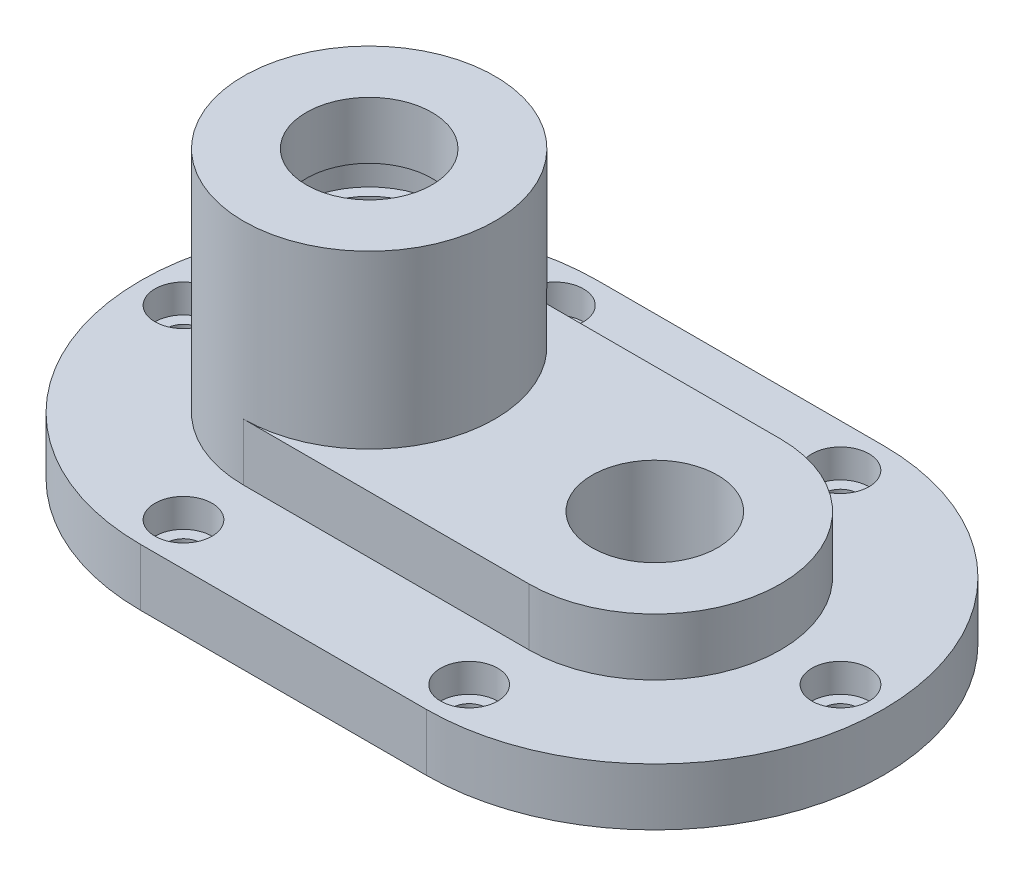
ISO-10303-21;
HEADER;
FILE_DESCRIPTION(('STEP AP214'),'2;1');
FILE_NAME('part.step','',(''),(''),'','','');
FILE_SCHEMA(('AUTOMOTIVE_DESIGN { 1 0 10303 214 1 1 1 1 }'));
ENDSEC;
DATA;
#1=APPLICATION_CONTEXT('core data for automotive mechanical design processes');
#2=APPLICATION_PROTOCOL_DEFINITION('international standard','automotive_design',2000,#1);
#3=PRODUCT_CONTEXT('',#1,'mechanical');
#4=PRODUCT('Part','Part','',(#3));
#5=PRODUCT_RELATED_PRODUCT_CATEGORY('part','',(#4));
#6=PRODUCT_DEFINITION_FORMATION('','',#4);
#7=PRODUCT_DEFINITION_CONTEXT('part definition',#1,'design');
#8=PRODUCT_DEFINITION('design','',#6,#7);
#9=PRODUCT_DEFINITION_SHAPE('','',#8);
#10=(LENGTH_UNIT() NAMED_UNIT(*) SI_UNIT(.MILLI.,.METRE.));
#11=(NAMED_UNIT(*) PLANE_ANGLE_UNIT() SI_UNIT($,.RADIAN.));
#12=(NAMED_UNIT(*) SI_UNIT($,.STERADIAN.) SOLID_ANGLE_UNIT());
#13=UNCERTAINTY_MEASURE_WITH_UNIT(LENGTH_MEASURE(1.E-05),#10,'distance_accuracy_value','');
#14=(GEOMETRIC_REPRESENTATION_CONTEXT(3) GLOBAL_UNCERTAINTY_ASSIGNED_CONTEXT((#13)) GLOBAL_UNIT_ASSIGNED_CONTEXT((#10,
#11,#12)) REPRESENTATION_CONTEXT('',''));
#15=CARTESIAN_POINT('',(0.,0.,0.));
#16=DIRECTION('',(0.,0.,1.));
#17=DIRECTION('',(1.,0.,0.));
#18=AXIS2_PLACEMENT_3D('',#15,#16,#17);
#19=CARTESIAN_POINT('',(0.,0.,-40.));
#20=DIRECTION('',(0.,1.,0.));
#21=DIRECTION('',(0.,0.,1.));
#22=AXIS2_PLACEMENT_3D('',#19,#20,#21);
#23=CYLINDRICAL_SURFACE('',#22,11.);
#24=CARTESIAN_POINT('',(0.,0.,-40.));
#25=DIRECTION('',(0.,1.,0.));
#26=DIRECTION('',(0.,0.,1.));
#27=AXIS2_PLACEMENT_3D('',#24,#25,#26);
#28=CIRCLE('',#27,11.);
#29=CARTESIAN_POINT('',(0.,0.,-29.));
#30=VERTEX_POINT('',#29);
#31=EDGE_CURVE('E361',#30,#30,#28,.T.);
#32=ORIENTED_EDGE('',*,*,#31,.F.);
#33=EDGE_LOOP('',(#32));
#34=FACE_BOUND('',#33,.T.);
#35=CARTESIAN_POINT('',(0.,35.,-40.));
#36=DIRECTION('',(0.,1.,0.));
#37=DIRECTION('',(0.,0.,1.));
#38=AXIS2_PLACEMENT_3D('',#35,#36,#37);
#39=CIRCLE('',#38,11.);
#40=CARTESIAN_POINT('',(0.,35.,-29.));
#41=VERTEX_POINT('',#40);
#42=EDGE_CURVE('E376',#41,#41,#39,.T.);
#43=ORIENTED_EDGE('',*,*,#42,.T.);
#44=EDGE_LOOP('',(#43));
#45=FACE_BOUND('',#44,.T.);
#46=ADVANCED_FACE('F45',(#34,#45),#23,.F.);
#47=CARTESIAN_POINT('',(0.,10.,-40.));
#48=DIRECTION('',(0.,-1.,0.));
#49=DIRECTION('',(0.,0.,-1.));
#50=AXIS2_PLACEMENT_3D('',#47,#48,#49);
#51=PLANE('',#50);
#52=CARTESIAN_POINT('',(0.,10.,-40.));
#53=DIRECTION('',(0.,1.,0.));
#54=DIRECTION('',(0.,0.,-1.));
#55=AXIS2_PLACEMENT_3D('',#52,#53,#54);
#56=CIRCLE('',#55,40.);
#57=CARTESIAN_POINT('',(0.,10.,-80.));
#58=VERTEX_POINT('',#57);
#59=CARTESIAN_POINT('',(0.,10.,0.));
#60=VERTEX_POINT('',#59);
#61=EDGE_CURVE('E266',#58,#60,#56,.T.);
#62=ORIENTED_EDGE('',*,*,#61,.T.);
#63=DIRECTION('',(1.,0.,0.));
#64=VECTOR('',#63,1.);
#65=CARTESIAN_POINT('',(0.,10.,0.));
#66=LINE('',#65,#64);
#67=CARTESIAN_POINT('',(50.,10.,0.));
#68=VERTEX_POINT('',#67);
#69=EDGE_CURVE('E270',#60,#68,#66,.T.);
#70=ORIENTED_EDGE('',*,*,#69,.T.);
#71=CARTESIAN_POINT('',(50.,10.,-40.));
#72=DIRECTION('',(0.,1.,0.));
#73=DIRECTION('',(0.,0.,1.));
#74=AXIS2_PLACEMENT_3D('',#71,#72,#73);
#75=CIRCLE('',#74,40.);
#76=CARTESIAN_POINT('',(50.,10.,-80.));
#77=VERTEX_POINT('',#76);
#78=EDGE_CURVE('E274',#68,#77,#75,.T.);
#79=ORIENTED_EDGE('',*,*,#78,.T.);
#80=DIRECTION('',(-1.,0.,0.));
#81=VECTOR('',#80,1.);
#82=CARTESIAN_POINT('',(50.,10.,-80.));
#83=LINE('',#82,#81);
#84=EDGE_CURVE('E277',#77,#58,#83,.T.);
#85=ORIENTED_EDGE('',*,*,#84,.T.);
#86=EDGE_LOOP('',(#62,#70,#79,#85));
#87=FACE_BOUND('',#86,.T.);
#88=CARTESIAN_POINT('',(0.,10.,-72.5));
#89=DIRECTION('',(0.,1.,0.));
#90=DIRECTION('',(0.,0.,1.));
#91=AXIS2_PLACEMENT_3D('',#88,#89,#90);
#92=CIRCLE('',#91,5.);
#93=CARTESIAN_POINT('',(0.,10.,-67.5));
#94=VERTEX_POINT('',#93);
#95=EDGE_CURVE('E222',#94,#94,#92,.T.);
#96=ORIENTED_EDGE('',*,*,#95,.F.);
#97=EDGE_LOOP('',(#96));
#98=FACE_BOUND('',#97,.T.);
#99=CARTESIAN_POINT('',(50.,10.,-72.5));
#100=DIRECTION('',(0.,1.,0.));
#101=DIRECTION('',(0.,0.,1.));
#102=AXIS2_PLACEMENT_3D('',#99,#100,#101);
#103=CIRCLE('',#102,5.);
#104=CARTESIAN_POINT('',(50.,10.,-67.5));
#105=VERTEX_POINT('',#104);
#106=EDGE_CURVE('E223',#105,#105,#103,.T.);
#107=ORIENTED_EDGE('',*,*,#106,.F.);
#108=EDGE_LOOP('',(#107));
#109=FACE_BOUND('',#108,.T.);
#110=CARTESIAN_POINT('',(-32.5,10.,-40.));
#111=DIRECTION('',(0.,1.,0.));
#112=DIRECTION('',(0.,0.,1.));
#113=AXIS2_PLACEMENT_3D('',#110,#111,#112);
#114=CIRCLE('',#113,5.);
#115=CARTESIAN_POINT('',(-32.5,10.,-35.));
#116=VERTEX_POINT('',#115);
#117=EDGE_CURVE('E231',#116,#116,#114,.T.);
#118=ORIENTED_EDGE('',*,*,#117,.F.);
#119=EDGE_LOOP('',(#118));
#120=FACE_BOUND('',#119,.T.);
#121=CARTESIAN_POINT('',(0.,10.,-7.5));
#122=DIRECTION('',(0.,1.,0.));
#123=DIRECTION('',(0.,0.,1.));
#124=AXIS2_PLACEMENT_3D('',#121,#122,#123);
#125=CIRCLE('',#124,5.);
#126=CARTESIAN_POINT('',(0.,10.,-2.5));
#127=VERTEX_POINT('',#126);
#128=EDGE_CURVE('E239',#127,#127,#125,.T.);
#129=ORIENTED_EDGE('',*,*,#128,.F.);
#130=EDGE_LOOP('',(#129));
#131=FACE_BOUND('',#130,.T.);
#132=CARTESIAN_POINT('',(50.,10.,-7.5));
#133=DIRECTION('',(0.,1.,0.));
#134=DIRECTION('',(0.,0.,1.));
#135=AXIS2_PLACEMENT_3D('',#132,#133,#134);
#136=CIRCLE('',#135,5.);
#137=CARTESIAN_POINT('',(50.,10.,-2.5));
#138=VERTEX_POINT('',#137);
#139=EDGE_CURVE('E247',#138,#138,#136,.T.);
#140=ORIENTED_EDGE('',*,*,#139,.F.);
#141=EDGE_LOOP('',(#140));
#142=FACE_BOUND('',#141,.T.);
#143=CARTESIAN_POINT('',(82.5,10.,-40.));
#144=DIRECTION('',(0.,1.,0.));
#145=DIRECTION('',(0.,0.,1.));
#146=AXIS2_PLACEMENT_3D('',#143,#144,#145);
#147=CIRCLE('',#146,5.00000000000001);
#148=CARTESIAN_POINT('',(82.5,10.,-35.));
#149=VERTEX_POINT('',#148);
#150=EDGE_CURVE('E174',#149,#149,#147,.T.);
#151=ORIENTED_EDGE('',*,*,#150,.F.);
#152=EDGE_LOOP('',(#151));
#153=FACE_BOUND('',#152,.T.);
#154=CARTESIAN_POINT('',(50.,10.,-40.));
#155=DIRECTION('',(0.,1.,0.));
#156=DIRECTION('',(0.,0.,1.));
#157=AXIS2_PLACEMENT_3D('',#154,#155,#156);
#158=CIRCLE('',#157,22.);
#159=CARTESIAN_POINT('',(50.,10.,-18.));
#160=VERTEX_POINT('',#159);
#161=CARTESIAN_POINT('',(50.,10.,-62.));
#162=VERTEX_POINT('',#161);
#163=EDGE_CURVE('E141',#160,#162,#158,.T.);
#164=ORIENTED_EDGE('',*,*,#163,.F.);
#165=DIRECTION('',(1.,0.,0.));
#166=VECTOR('',#165,1.);
#167=CARTESIAN_POINT('',(0.,10.,-18.));
#168=LINE('',#167,#166);
#169=CARTESIAN_POINT('',(0.,10.,-18.));
#170=VERTEX_POINT('',#169);
#171=EDGE_CURVE('E150',#170,#160,#168,.T.);
#172=ORIENTED_EDGE('',*,*,#171,.F.);
#173=CARTESIAN_POINT('',(0.,10.,-40.));
#174=DIRECTION('',(0.,1.,0.));
#175=DIRECTION('',(0.,0.,1.));
#176=AXIS2_PLACEMENT_3D('',#173,#174,#175);
#177=CIRCLE('',#176,22.);
#178=CARTESIAN_POINT('',(0.,10.,-62.));
#179=VERTEX_POINT('',#178);
#180=EDGE_CURVE('E67',#179,#170,#177,.T.);
#181=ORIENTED_EDGE('',*,*,#180,.F.);
#182=DIRECTION('',(-1.,0.,0.));
#183=VECTOR('',#182,1.);
#184=CARTESIAN_POINT('',(50.,10.,-62.));
#185=LINE('',#184,#183);
#186=EDGE_CURVE('E62',#162,#179,#185,.T.);
#187=ORIENTED_EDGE('',*,*,#186,.F.);
#188=EDGE_LOOP('',(#164,#172,#181,#187));
#189=FACE_BOUND('',#188,.T.);
#190=ADVANCED_FACE('F320',(#87,#98,#109,#120,#131,#142,#153,#189),#51,.F.);
#191=CARTESIAN_POINT('',(0.,10.,-40.));
#192=DIRECTION('',(0.,-1.,0.));
#193=DIRECTION('',(0.,0.,-1.));
#194=AXIS2_PLACEMENT_3D('',#191,#192,#193);
#195=CYLINDRICAL_SURFACE('',#194,40.);
#196=CARTESIAN_POINT('',(0.,0.,-40.));
#197=DIRECTION('',(0.,1.,0.));
#198=DIRECTION('',(0.,0.,-1.));
#199=AXIS2_PLACEMENT_3D('',#196,#197,#198);
#200=CIRCLE('',#199,40.);
#201=CARTESIAN_POINT('',(0.,0.,-80.));
#202=VERTEX_POINT('',#201);
#203=CARTESIAN_POINT('',(0.,0.,0.));
#204=VERTEX_POINT('',#203);
#205=EDGE_CURVE('E262',#202,#204,#200,.T.);
#206=ORIENTED_EDGE('',*,*,#205,.T.);
#207=DIRECTION('',(0.,-1.,0.));
#208=VECTOR('',#207,1.);
#209=CARTESIAN_POINT('',(0.,10.,0.));
#210=LINE('',#209,#208);
#211=EDGE_CURVE('E11',#60,#204,#210,.T.);
#212=ORIENTED_EDGE('',*,*,#211,.F.);
#213=ORIENTED_EDGE('',*,*,#61,.F.);
#214=DIRECTION('',(0.,-1.,0.));
#215=VECTOR('',#214,1.);
#216=CARTESIAN_POINT('',(0.,10.,-80.));
#217=LINE('',#216,#215);
#218=EDGE_CURVE('E280',#58,#202,#217,.T.);
#219=ORIENTED_EDGE('',*,*,#218,.T.);
#220=EDGE_LOOP('',(#206,#212,#213,#219));
#221=FACE_BOUND('',#220,.T.);
#222=ADVANCED_FACE('F47',(#221),#195,.T.);
#223=CARTESIAN_POINT('',(0.,10.,0.));
#224=DIRECTION('',(0.,0.,-1.));
#225=DIRECTION('',(-1.,0.,0.));
#226=AXIS2_PLACEMENT_3D('',#223,#224,#225);
#227=PLANE('',#226);
#228=DIRECTION('',(1.,0.,0.));
#229=VECTOR('',#228,1.);
#230=CARTESIAN_POINT('',(0.,0.,0.));
#231=LINE('',#230,#229);
#232=CARTESIAN_POINT('',(50.,0.,0.));
#233=VERTEX_POINT('',#232);
#234=EDGE_CURVE('E284',#204,#233,#231,.T.);
#235=ORIENTED_EDGE('',*,*,#234,.T.);
#236=DIRECTION('',(0.,-1.,0.));
#237=VECTOR('',#236,1.);
#238=CARTESIAN_POINT('',(50.,10.,0.));
#239=LINE('',#238,#237);
#240=EDGE_CURVE('E55',#68,#233,#239,.T.);
#241=ORIENTED_EDGE('',*,*,#240,.F.);
#242=ORIENTED_EDGE('',*,*,#69,.F.);
#243=ORIENTED_EDGE('',*,*,#211,.T.);
#244=EDGE_LOOP('',(#235,#241,#242,#243));
#245=FACE_BOUND('',#244,.T.);
#246=ADVANCED_FACE('F322',(#245),#227,.F.);
#247=CARTESIAN_POINT('',(50.,10.,-40.));
#248=DIRECTION('',(0.,-1.,0.));
#249=DIRECTION('',(0.,0.,-1.));
#250=AXIS2_PLACEMENT_3D('',#247,#248,#249);
#251=CYLINDRICAL_SURFACE('',#250,40.);
#252=CARTESIAN_POINT('',(50.,0.,-40.));
#253=DIRECTION('',(0.,1.,0.));
#254=DIRECTION('',(0.,0.,1.));
#255=AXIS2_PLACEMENT_3D('',#252,#253,#254);
#256=CIRCLE('',#255,40.);
#257=CARTESIAN_POINT('',(50.,0.,-80.));
#258=VERTEX_POINT('',#257);
#259=EDGE_CURVE('E287',#233,#258,#256,.T.);
#260=ORIENTED_EDGE('',*,*,#259,.T.);
#261=DIRECTION('',(0.,-1.,0.));
#262=VECTOR('',#261,1.);
#263=CARTESIAN_POINT('',(50.,10.,-80.));
#264=LINE('',#263,#262);
#265=EDGE_CURVE('E295',#77,#258,#264,.T.);
#266=ORIENTED_EDGE('',*,*,#265,.F.);
#267=ORIENTED_EDGE('',*,*,#78,.F.);
#268=ORIENTED_EDGE('',*,*,#240,.T.);
#269=EDGE_LOOP('',(#260,#266,#267,#268));
#270=FACE_BOUND('',#269,.T.);
#271=ADVANCED_FACE('F305',(#270),#251,.T.);
#272=CARTESIAN_POINT('',(50.,10.,-80.));
#273=DIRECTION('',(0.,0.,1.));
#274=DIRECTION('',(1.,0.,0.));
#275=AXIS2_PLACEMENT_3D('',#272,#273,#274);
#276=PLANE('',#275);
#277=DIRECTION('',(-1.,0.,0.));
#278=VECTOR('',#277,1.);
#279=CARTESIAN_POINT('',(50.,0.,-80.));
#280=LINE('',#279,#278);
#281=EDGE_CURVE('E271',#258,#202,#280,.T.);
#282=ORIENTED_EDGE('',*,*,#281,.T.);
#283=ORIENTED_EDGE('',*,*,#218,.F.);
#284=ORIENTED_EDGE('',*,*,#84,.F.);
#285=ORIENTED_EDGE('',*,*,#265,.T.);
#286=EDGE_LOOP('',(#282,#283,#284,#285));
#287=FACE_BOUND('',#286,.T.);
#288=ADVANCED_FACE('F314',(#287),#276,.F.);
#289=CARTESIAN_POINT('',(0.,0.,-40.));
#290=DIRECTION('',(0.,-1.,0.));
#291=DIRECTION('',(0.,0.,-1.));
#292=AXIS2_PLACEMENT_3D('',#289,#290,#291);
#293=PLANE('',#292);
#294=CARTESIAN_POINT('',(50.,0.,-40.));
#295=DIRECTION('',(0.,1.,0.));
#296=DIRECTION('',(0.,0.,1.));
#297=AXIS2_PLACEMENT_3D('',#294,#295,#296);
#298=CIRCLE('',#297,11.);
#299=CARTESIAN_POINT('',(50.,0.,-29.));
#300=VERTEX_POINT('',#299);
#301=EDGE_CURVE('E144',#300,#300,#298,.T.);
#302=ORIENTED_EDGE('',*,*,#301,.T.);
#303=EDGE_LOOP('',(#302));
#304=FACE_BOUND('',#303,.T.);
#305=ORIENTED_EDGE('',*,*,#31,.T.);
#306=EDGE_LOOP('',(#305));
#307=FACE_BOUND('',#306,.T.);
#308=CARTESIAN_POINT('',(-32.5,0.,-40.));
#309=DIRECTION('',(0.,1.,0.));
#310=DIRECTION('',(0.,0.,1.));
#311=AXIS2_PLACEMENT_3D('',#308,#309,#310);
#312=CIRCLE('',#311,3.);
#313=CARTESIAN_POINT('',(-32.5,0.,-37.));
#314=VERTEX_POINT('',#313);
#315=EDGE_CURVE('E170',#314,#314,#312,.T.);
#316=ORIENTED_EDGE('',*,*,#315,.T.);
#317=EDGE_LOOP('',(#316));
#318=FACE_BOUND('',#317,.T.);
#319=CARTESIAN_POINT('',(0.,0.,-7.5));
#320=DIRECTION('',(0.,1.,0.));
#321=DIRECTION('',(0.,0.,1.));
#322=AXIS2_PLACEMENT_3D('',#319,#320,#321);
#323=CIRCLE('',#322,3.);
#324=CARTESIAN_POINT('',(0.,0.,-4.5));
#325=VERTEX_POINT('',#324);
#326=EDGE_CURVE('E169',#325,#325,#323,.T.);
#327=ORIENTED_EDGE('',*,*,#326,.T.);
#328=EDGE_LOOP('',(#327));
#329=FACE_BOUND('',#328,.T.);
#330=CARTESIAN_POINT('',(50.,0.,-7.5));
#331=DIRECTION('',(0.,1.,0.));
#332=DIRECTION('',(0.,0.,1.));
#333=AXIS2_PLACEMENT_3D('',#330,#331,#332);
#334=CIRCLE('',#333,3.);
#335=CARTESIAN_POINT('',(50.,0.,-4.5));
#336=VERTEX_POINT('',#335);
#337=EDGE_CURVE('E184',#336,#336,#334,.T.);
#338=ORIENTED_EDGE('',*,*,#337,.T.);
#339=EDGE_LOOP('',(#338));
#340=FACE_BOUND('',#339,.T.);
#341=CARTESIAN_POINT('',(82.5,0.,-40.));
#342=DIRECTION('',(0.,1.,0.));
#343=DIRECTION('',(0.,0.,1.));
#344=AXIS2_PLACEMENT_3D('',#341,#342,#343);
#345=CIRCLE('',#344,3.00000000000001);
#346=CARTESIAN_POINT('',(82.5,0.,-37.));
#347=VERTEX_POINT('',#346);
#348=EDGE_CURVE('E207',#347,#347,#345,.T.);
#349=ORIENTED_EDGE('',*,*,#348,.T.);
#350=EDGE_LOOP('',(#349));
#351=FACE_BOUND('',#350,.T.);
#352=CARTESIAN_POINT('',(50.,0.,-72.5));
#353=DIRECTION('',(0.,1.,0.));
#354=DIRECTION('',(0.,0.,1.));
#355=AXIS2_PLACEMENT_3D('',#352,#353,#354);
#356=CIRCLE('',#355,3.);
#357=CARTESIAN_POINT('',(50.,0.,-69.5));
#358=VERTEX_POINT('',#357);
#359=EDGE_CURVE('E199',#358,#358,#356,.T.);
#360=ORIENTED_EDGE('',*,*,#359,.T.);
#361=EDGE_LOOP('',(#360));
#362=FACE_BOUND('',#361,.T.);
#363=CARTESIAN_POINT('',(0.,0.,-72.5));
#364=DIRECTION('',(0.,1.,0.));
#365=DIRECTION('',(0.,0.,1.));
#366=AXIS2_PLACEMENT_3D('',#363,#364,#365);
#367=CIRCLE('',#366,3.);
#368=CARTESIAN_POINT('',(0.,0.,-69.5));
#369=VERTEX_POINT('',#368);
#370=EDGE_CURVE('E191',#369,#369,#367,.T.);
#371=ORIENTED_EDGE('',*,*,#370,.T.);
#372=EDGE_LOOP('',(#371));
#373=FACE_BOUND('',#372,.T.);
#374=ORIENTED_EDGE('',*,*,#205,.F.);
#375=ORIENTED_EDGE('',*,*,#281,.F.);
#376=ORIENTED_EDGE('',*,*,#259,.F.);
#377=ORIENTED_EDGE('',*,*,#234,.F.);
#378=EDGE_LOOP('',(#374,#375,#376,#377));
#379=FACE_BOUND('',#378,.T.);
#380=ADVANCED_FACE('F311',(#304,#307,#318,#329,#340,#351,#362,#373,#379),#293,.T.);
#381=CARTESIAN_POINT('',(0.,5.,-72.5));
#382=DIRECTION('',(0.,1.,0.));
#383=DIRECTION('',(0.,0.,1.));
#384=AXIS2_PLACEMENT_3D('',#381,#382,#383);
#385=CYLINDRICAL_SURFACE('',#384,5.);
#386=CARTESIAN_POINT('',(0.,5.,-72.5));
#387=DIRECTION('',(0.,1.,0.));
#388=DIRECTION('',(0.,0.,1.));
#389=AXIS2_PLACEMENT_3D('',#386,#387,#388);
#390=CIRCLE('',#389,5.);
#391=CARTESIAN_POINT('',(0.,5.,-67.5));
#392=VERTEX_POINT('',#391);
#393=EDGE_CURVE('E258',#392,#392,#390,.T.);
#394=ORIENTED_EDGE('',*,*,#393,.F.);
#395=EDGE_LOOP('',(#394));
#396=FACE_BOUND('',#395,.T.);
#397=ORIENTED_EDGE('',*,*,#95,.T.);
#398=EDGE_LOOP('',(#397));
#399=FACE_BOUND('',#398,.T.);
#400=ADVANCED_FACE('F655',(#396,#399),#385,.F.);
#401=CARTESIAN_POINT('',(0.,5.,0.));
#402=DIRECTION('',(0.,1.,0.));
#403=DIRECTION('',(0.,0.,1.));
#404=AXIS2_PLACEMENT_3D('',#401,#402,#403);
#405=PLANE('',#404);
#406=CARTESIAN_POINT('',(0.,5.,-72.5));
#407=DIRECTION('',(0.,1.,0.));
#408=DIRECTION('',(0.,0.,1.));
#409=AXIS2_PLACEMENT_3D('',#406,#407,#408);
#410=CIRCLE('',#409,3.);
#411=CARTESIAN_POINT('',(0.,5.,-69.5));
#412=VERTEX_POINT('',#411);
#413=EDGE_CURVE('E179',#412,#412,#410,.T.);
#414=ORIENTED_EDGE('',*,*,#413,.F.);
#415=EDGE_LOOP('',(#414));
#416=FACE_BOUND('',#415,.T.);
#417=ORIENTED_EDGE('',*,*,#393,.T.);
#418=EDGE_LOOP('',(#417));
#419=FACE_BOUND('',#418,.T.);
#420=ADVANCED_FACE('F645',(#416,#419),#405,.T.);
#421=CARTESIAN_POINT('',(50.,5.,-72.5));
#422=DIRECTION('',(0.,1.,0.));
#423=DIRECTION('',(0.,0.,1.));
#424=AXIS2_PLACEMENT_3D('',#421,#422,#423);
#425=CYLINDRICAL_SURFACE('',#424,5.);
#426=CARTESIAN_POINT('',(50.,5.,-72.5));
#427=DIRECTION('',(0.,1.,0.));
#428=DIRECTION('',(0.,0.,1.));
#429=AXIS2_PLACEMENT_3D('',#426,#427,#428);
#430=CIRCLE('',#429,5.);
#431=CARTESIAN_POINT('',(50.,5.,-67.5));
#432=VERTEX_POINT('',#431);
#433=EDGE_CURVE('E218',#432,#432,#430,.T.);
#434=ORIENTED_EDGE('',*,*,#433,.F.);
#435=EDGE_LOOP('',(#434));
#436=FACE_BOUND('',#435,.T.);
#437=ORIENTED_EDGE('',*,*,#106,.T.);
#438=EDGE_LOOP('',(#437));
#439=FACE_BOUND('',#438,.T.);
#440=ADVANCED_FACE('F636',(#436,#439),#425,.F.);
#441=CARTESIAN_POINT('',(0.,5.,0.));
#442=DIRECTION('',(0.,1.,0.));
#443=DIRECTION('',(0.,0.,1.));
#444=AXIS2_PLACEMENT_3D('',#441,#442,#443);
#445=PLANE('',#444);
#446=CARTESIAN_POINT('',(50.,5.,-72.5));
#447=DIRECTION('',(0.,1.,0.));
#448=DIRECTION('',(0.,0.,1.));
#449=AXIS2_PLACEMENT_3D('',#446,#447,#448);
#450=CIRCLE('',#449,3.);
#451=CARTESIAN_POINT('',(50.,5.,-69.5));
#452=VERTEX_POINT('',#451);
#453=EDGE_CURVE('E195',#452,#452,#450,.T.);
#454=ORIENTED_EDGE('',*,*,#453,.F.);
#455=EDGE_LOOP('',(#454));
#456=FACE_BOUND('',#455,.T.);
#457=ORIENTED_EDGE('',*,*,#433,.T.);
#458=EDGE_LOOP('',(#457));
#459=FACE_BOUND('',#458,.T.);
#460=ADVANCED_FACE('F626',(#456,#459),#445,.T.);
#461=CARTESIAN_POINT('',(-32.5,5.,-40.));
#462=DIRECTION('',(0.,1.,0.));
#463=DIRECTION('',(0.,0.,1.));
#464=AXIS2_PLACEMENT_3D('',#461,#462,#463);
#465=CYLINDRICAL_SURFACE('',#464,5.);
#466=CARTESIAN_POINT('',(-32.5,5.,-40.));
#467=DIRECTION('',(0.,1.,0.));
#468=DIRECTION('',(0.,0.,1.));
#469=AXIS2_PLACEMENT_3D('',#466,#467,#468);
#470=CIRCLE('',#469,5.);
#471=CARTESIAN_POINT('',(-32.5,5.,-35.));
#472=VERTEX_POINT('',#471);
#473=EDGE_CURVE('E227',#472,#472,#470,.T.);
#474=ORIENTED_EDGE('',*,*,#473,.F.);
#475=EDGE_LOOP('',(#474));
#476=FACE_BOUND('',#475,.T.);
#477=ORIENTED_EDGE('',*,*,#117,.T.);
#478=EDGE_LOOP('',(#477));
#479=FACE_BOUND('',#478,.T.);
#480=ADVANCED_FACE('F616',(#476,#479),#465,.F.);
#481=CARTESIAN_POINT('',(0.,5.,0.));
#482=DIRECTION('',(0.,1.,0.));
#483=DIRECTION('',(0.,0.,1.));
#484=AXIS2_PLACEMENT_3D('',#481,#482,#483);
#485=PLANE('',#484);
#486=CARTESIAN_POINT('',(-32.5,5.,-40.));
#487=DIRECTION('',(0.,1.,0.));
#488=DIRECTION('',(0.,0.,1.));
#489=AXIS2_PLACEMENT_3D('',#486,#487,#488);
#490=CIRCLE('',#489,3.);
#491=CARTESIAN_POINT('',(-32.5,5.,-37.));
#492=VERTEX_POINT('',#491);
#493=EDGE_CURVE('E175',#492,#492,#490,.T.);
#494=ORIENTED_EDGE('',*,*,#493,.F.);
#495=EDGE_LOOP('',(#494));
#496=FACE_BOUND('',#495,.T.);
#497=ORIENTED_EDGE('',*,*,#473,.T.);
#498=EDGE_LOOP('',(#497));
#499=FACE_BOUND('',#498,.T.);
#500=ADVANCED_FACE('F606',(#496,#499),#485,.T.);
#501=CARTESIAN_POINT('',(0.,5.,-7.5));
#502=DIRECTION('',(0.,1.,0.));
#503=DIRECTION('',(0.,0.,1.));
#504=AXIS2_PLACEMENT_3D('',#501,#502,#503);
#505=CYLINDRICAL_SURFACE('',#504,5.);
#506=CARTESIAN_POINT('',(0.,5.,-7.5));
#507=DIRECTION('',(0.,1.,0.));
#508=DIRECTION('',(0.,0.,1.));
#509=AXIS2_PLACEMENT_3D('',#506,#507,#508);
#510=CIRCLE('',#509,5.);
#511=CARTESIAN_POINT('',(0.,5.,-2.5));
#512=VERTEX_POINT('',#511);
#513=EDGE_CURVE('E235',#512,#512,#510,.T.);
#514=ORIENTED_EDGE('',*,*,#513,.F.);
#515=EDGE_LOOP('',(#514));
#516=FACE_BOUND('',#515,.T.);
#517=ORIENTED_EDGE('',*,*,#128,.T.);
#518=EDGE_LOOP('',(#517));
#519=FACE_BOUND('',#518,.T.);
#520=ADVANCED_FACE('F596',(#516,#519),#505,.F.);
#521=CARTESIAN_POINT('',(0.,5.,0.));
#522=DIRECTION('',(0.,1.,0.));
#523=DIRECTION('',(0.,0.,1.));
#524=AXIS2_PLACEMENT_3D('',#521,#522,#523);
#525=PLANE('',#524);
#526=CARTESIAN_POINT('',(0.,5.,-7.5));
#527=DIRECTION('',(0.,1.,0.));
#528=DIRECTION('',(0.,0.,1.));
#529=AXIS2_PLACEMENT_3D('',#526,#527,#528);
#530=CIRCLE('',#529,3.);
#531=CARTESIAN_POINT('',(0.,5.,-4.5));
#532=VERTEX_POINT('',#531);
#533=EDGE_CURVE('E180',#532,#532,#530,.T.);
#534=ORIENTED_EDGE('',*,*,#533,.F.);
#535=EDGE_LOOP('',(#534));
#536=FACE_BOUND('',#535,.T.);
#537=ORIENTED_EDGE('',*,*,#513,.T.);
#538=EDGE_LOOP('',(#537));
#539=FACE_BOUND('',#538,.T.);
#540=ADVANCED_FACE('F586',(#536,#539),#525,.T.);
#541=CARTESIAN_POINT('',(50.,5.,-7.5));
#542=DIRECTION('',(0.,1.,0.));
#543=DIRECTION('',(0.,0.,1.));
#544=AXIS2_PLACEMENT_3D('',#541,#542,#543);
#545=CYLINDRICAL_SURFACE('',#544,5.);
#546=CARTESIAN_POINT('',(50.,5.,-7.5));
#547=DIRECTION('',(0.,1.,0.));
#548=DIRECTION('',(0.,0.,1.));
#549=AXIS2_PLACEMENT_3D('',#546,#547,#548);
#550=CIRCLE('',#549,5.);
#551=CARTESIAN_POINT('',(50.,5.,-2.5));
#552=VERTEX_POINT('',#551);
#553=EDGE_CURVE('E243',#552,#552,#550,.T.);
#554=ORIENTED_EDGE('',*,*,#553,.F.);
#555=EDGE_LOOP('',(#554));
#556=FACE_BOUND('',#555,.T.);
#557=ORIENTED_EDGE('',*,*,#139,.T.);
#558=EDGE_LOOP('',(#557));
#559=FACE_BOUND('',#558,.T.);
#560=ADVANCED_FACE('F576',(#556,#559),#545,.F.);
#561=CARTESIAN_POINT('',(0.,5.,0.));
#562=DIRECTION('',(0.,1.,0.));
#563=DIRECTION('',(0.,0.,1.));
#564=AXIS2_PLACEMENT_3D('',#561,#562,#563);
#565=PLANE('',#564);
#566=CARTESIAN_POINT('',(50.,5.,-7.5));
#567=DIRECTION('',(0.,1.,0.));
#568=DIRECTION('',(0.,0.,1.));
#569=AXIS2_PLACEMENT_3D('',#566,#567,#568);
#570=CIRCLE('',#569,3.);
#571=CARTESIAN_POINT('',(50.,5.,-4.5));
#572=VERTEX_POINT('',#571);
#573=EDGE_CURVE('E211',#572,#572,#570,.T.);
#574=ORIENTED_EDGE('',*,*,#573,.F.);
#575=EDGE_LOOP('',(#574));
#576=FACE_BOUND('',#575,.T.);
#577=ORIENTED_EDGE('',*,*,#553,.T.);
#578=EDGE_LOOP('',(#577));
#579=FACE_BOUND('',#578,.T.);
#580=ADVANCED_FACE('F565',(#576,#579),#565,.T.);
#581=CARTESIAN_POINT('',(82.5,5.,-40.));
#582=DIRECTION('',(0.,1.,0.));
#583=DIRECTION('',(0.,0.,1.));
#584=AXIS2_PLACEMENT_3D('',#581,#582,#583);
#585=CYLINDRICAL_SURFACE('',#584,5.00000000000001);
#586=CARTESIAN_POINT('',(82.5,5.,-40.));
#587=DIRECTION('',(0.,1.,0.));
#588=DIRECTION('',(0.,0.,1.));
#589=AXIS2_PLACEMENT_3D('',#586,#587,#588);
#590=CIRCLE('',#589,5.00000000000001);
#591=CARTESIAN_POINT('',(82.5,5.,-35.));
#592=VERTEX_POINT('',#591);
#593=EDGE_CURVE('E251',#592,#592,#590,.T.);
#594=ORIENTED_EDGE('',*,*,#593,.F.);
#595=EDGE_LOOP('',(#594));
#596=FACE_BOUND('',#595,.T.);
#597=ORIENTED_EDGE('',*,*,#150,.T.);
#598=EDGE_LOOP('',(#597));
#599=FACE_BOUND('',#598,.T.);
#600=ADVANCED_FACE('F554',(#596,#599),#585,.F.);
#601=CARTESIAN_POINT('',(0.,5.,0.));
#602=DIRECTION('',(0.,1.,0.));
#603=DIRECTION('',(0.,0.,1.));
#604=AXIS2_PLACEMENT_3D('',#601,#602,#603);
#605=PLANE('',#604);
#606=CARTESIAN_POINT('',(82.5,5.,-40.));
#607=DIRECTION('',(0.,1.,0.));
#608=DIRECTION('',(0.,0.,1.));
#609=AXIS2_PLACEMENT_3D('',#606,#607,#608);
#610=CIRCLE('',#609,3.00000000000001);
#611=CARTESIAN_POINT('',(82.5,5.,-37.));
#612=VERTEX_POINT('',#611);
#613=EDGE_CURVE('E203',#612,#612,#610,.T.);
#614=ORIENTED_EDGE('',*,*,#613,.F.);
#615=EDGE_LOOP('',(#614));
#616=FACE_BOUND('',#615,.T.);
#617=ORIENTED_EDGE('',*,*,#593,.T.);
#618=EDGE_LOOP('',(#617));
#619=FACE_BOUND('',#618,.T.);
#620=ADVANCED_FACE('F544',(#616,#619),#605,.T.);
#621=CARTESIAN_POINT('',(0.,0.,-72.5));
#622=DIRECTION('',(0.,1.,0.));
#623=DIRECTION('',(0.,0.,1.));
#624=AXIS2_PLACEMENT_3D('',#621,#622,#623);
#625=CYLINDRICAL_SURFACE('',#624,3.);
#626=ORIENTED_EDGE('',*,*,#370,.F.);
#627=EDGE_LOOP('',(#626));
#628=FACE_BOUND('',#627,.T.);
#629=ORIENTED_EDGE('',*,*,#413,.T.);
#630=EDGE_LOOP('',(#629));
#631=FACE_BOUND('',#630,.T.);
#632=ADVANCED_FACE('F534',(#628,#631),#625,.F.);
#633=CARTESIAN_POINT('',(50.,0.,-72.5));
#634=DIRECTION('',(0.,1.,0.));
#635=DIRECTION('',(0.,0.,1.));
#636=AXIS2_PLACEMENT_3D('',#633,#634,#635);
#637=CYLINDRICAL_SURFACE('',#636,3.);
#638=ORIENTED_EDGE('',*,*,#359,.F.);
#639=EDGE_LOOP('',(#638));
#640=FACE_BOUND('',#639,.T.);
#641=ORIENTED_EDGE('',*,*,#453,.T.);
#642=EDGE_LOOP('',(#641));
#643=FACE_BOUND('',#642,.T.);
#644=ADVANCED_FACE('F524',(#640,#643),#637,.F.);
#645=CARTESIAN_POINT('',(82.5,0.,-40.));
#646=DIRECTION('',(0.,1.,0.));
#647=DIRECTION('',(0.,0.,1.));
#648=AXIS2_PLACEMENT_3D('',#645,#646,#647);
#649=CYLINDRICAL_SURFACE('',#648,3.00000000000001);
#650=ORIENTED_EDGE('',*,*,#348,.F.);
#651=EDGE_LOOP('',(#650));
#652=FACE_BOUND('',#651,.T.);
#653=ORIENTED_EDGE('',*,*,#613,.T.);
#654=EDGE_LOOP('',(#653));
#655=FACE_BOUND('',#654,.T.);
#656=ADVANCED_FACE('F514',(#652,#655),#649,.F.);
#657=CARTESIAN_POINT('',(50.,0.,-7.5));
#658=DIRECTION('',(0.,1.,0.));
#659=DIRECTION('',(0.,0.,1.));
#660=AXIS2_PLACEMENT_3D('',#657,#658,#659);
#661=CYLINDRICAL_SURFACE('',#660,3.);
#662=ORIENTED_EDGE('',*,*,#337,.F.);
#663=EDGE_LOOP('',(#662));
#664=FACE_BOUND('',#663,.T.);
#665=ORIENTED_EDGE('',*,*,#573,.T.);
#666=EDGE_LOOP('',(#665));
#667=FACE_BOUND('',#666,.T.);
#668=ADVANCED_FACE('F504',(#664,#667),#661,.F.);
#669=CARTESIAN_POINT('',(0.,0.,-7.5));
#670=DIRECTION('',(0.,1.,0.));
#671=DIRECTION('',(0.,0.,1.));
#672=AXIS2_PLACEMENT_3D('',#669,#670,#671);
#673=CYLINDRICAL_SURFACE('',#672,3.);
#674=ORIENTED_EDGE('',*,*,#326,.F.);
#675=EDGE_LOOP('',(#674));
#676=FACE_BOUND('',#675,.T.);
#677=ORIENTED_EDGE('',*,*,#533,.T.);
#678=EDGE_LOOP('',(#677));
#679=FACE_BOUND('',#678,.T.);
#680=ADVANCED_FACE('F494',(#676,#679),#673,.F.);
#681=CARTESIAN_POINT('',(-32.5,0.,-40.));
#682=DIRECTION('',(0.,1.,0.));
#683=DIRECTION('',(0.,0.,1.));
#684=AXIS2_PLACEMENT_3D('',#681,#682,#683);
#685=CYLINDRICAL_SURFACE('',#684,3.);
#686=ORIENTED_EDGE('',*,*,#315,.F.);
#687=EDGE_LOOP('',(#686));
#688=FACE_BOUND('',#687,.T.);
#689=ORIENTED_EDGE('',*,*,#493,.T.);
#690=EDGE_LOOP('',(#689));
#691=FACE_BOUND('',#690,.T.);
#692=ADVANCED_FACE('F480',(#688,#691),#685,.F.);
#693=CARTESIAN_POINT('',(50.,20.,-40.));
#694=DIRECTION('',(0.,-1.,0.));
#695=DIRECTION('',(0.,0.,-1.));
#696=AXIS2_PLACEMENT_3D('',#693,#694,#695);
#697=CYLINDRICAL_SURFACE('',#696,22.);
#698=ORIENTED_EDGE('',*,*,#163,.T.);
#699=DIRECTION('',(0.,-1.,0.));
#700=VECTOR('',#699,1.);
#701=CARTESIAN_POINT('',(50.,20.,-62.));
#702=LINE('',#701,#700);
#703=CARTESIAN_POINT('',(50.,20.,-62.));
#704=VERTEX_POINT('',#703);
#705=EDGE_CURVE('E166',#704,#162,#702,.T.);
#706=ORIENTED_EDGE('',*,*,#705,.F.);
#707=CARTESIAN_POINT('',(50.,20.,-40.));
#708=DIRECTION('',(0.,1.,0.));
#709=DIRECTION('',(0.,0.,1.));
#710=AXIS2_PLACEMENT_3D('',#707,#708,#709);
#711=CIRCLE('',#710,22.);
#712=CARTESIAN_POINT('',(50.,20.,-18.));
#713=VERTEX_POINT('',#712);
#714=EDGE_CURVE('E147',#713,#704,#711,.T.);
#715=ORIENTED_EDGE('',*,*,#714,.F.);
#716=DIRECTION('',(0.,-1.,0.));
#717=VECTOR('',#716,1.);
#718=CARTESIAN_POINT('',(50.,20.,-18.));
#719=LINE('',#718,#717);
#720=EDGE_CURVE('E116',#713,#160,#719,.T.);
#721=ORIENTED_EDGE('',*,*,#720,.T.);
#722=EDGE_LOOP('',(#698,#706,#715,#721));
#723=FACE_BOUND('',#722,.T.);
#724=ADVANCED_FACE('F466',(#723),#697,.T.);
#725=CARTESIAN_POINT('',(50.,20.,-62.));
#726=DIRECTION('',(0.,0.,1.));
#727=DIRECTION('',(1.,0.,0.));
#728=AXIS2_PLACEMENT_3D('',#725,#726,#727);
#729=PLANE('',#728);
#730=ORIENTED_EDGE('',*,*,#186,.T.);
#731=DIRECTION('',(0.,-1.,0.));
#732=VECTOR('',#731,1.);
#733=CARTESIAN_POINT('',(0.,20.,-62.));
#734=LINE('',#733,#732);
#735=CARTESIAN_POINT('',(0.,20.,-62.));
#736=VERTEX_POINT('',#735);
#737=EDGE_CURVE('E131',#736,#179,#734,.T.);
#738=ORIENTED_EDGE('',*,*,#737,.F.);
#739=DIRECTION('',(-1.,0.,0.));
#740=VECTOR('',#739,1.);
#741=CARTESIAN_POINT('',(50.,20.,-62.));
#742=LINE('',#741,#740);
#743=EDGE_CURVE('E122',#704,#736,#742,.T.);
#744=ORIENTED_EDGE('',*,*,#743,.F.);
#745=ORIENTED_EDGE('',*,*,#705,.T.);
#746=EDGE_LOOP('',(#730,#738,#744,#745));
#747=FACE_BOUND('',#746,.T.);
#748=ADVANCED_FACE('F442',(#747),#729,.F.);
#749=CARTESIAN_POINT('',(0.,20.,-40.));
#750=DIRECTION('',(0.,-1.,0.));
#751=DIRECTION('',(0.,0.,-1.));
#752=AXIS2_PLACEMENT_3D('',#749,#750,#751);
#753=CYLINDRICAL_SURFACE('',#752,22.);
#754=ORIENTED_EDGE('',*,*,#180,.T.);
#755=DIRECTION('',(0.,-1.,0.));
#756=VECTOR('',#755,1.);
#757=CARTESIAN_POINT('',(0.,20.,-18.));
#758=LINE('',#757,#756);
#759=CARTESIAN_POINT('',(0.,20.,-18.));
#760=VERTEX_POINT('',#759);
#761=EDGE_CURVE('E114',#760,#170,#758,.T.);
#762=ORIENTED_EDGE('',*,*,#761,.F.);
#763=CARTESIAN_POINT('',(0.,20.,-40.));
#764=DIRECTION('',(0.,1.,0.));
#765=DIRECTION('',(0.,0.,1.));
#766=AXIS2_PLACEMENT_3D('',#763,#764,#765);
#767=CIRCLE('',#766,22.);
#768=EDGE_CURVE('E129',#760,#736,#767,.T.);
#769=ORIENTED_EDGE('',*,*,#768,.T.);
#770=ORIENTED_EDGE('',*,*,#737,.T.);
#771=EDGE_LOOP('',(#754,#762,#769,#770));
#772=FACE_BOUND('',#771,.T.);
#773=CARTESIAN_POINT('',(0.,50.,-40.));
#774=DIRECTION('',(0.,1.,0.));
#775=DIRECTION('',(0.,0.,1.));
#776=AXIS2_PLACEMENT_3D('',#773,#774,#775);
#777=CIRCLE('',#776,22.);
#778=CARTESIAN_POINT('',(0.,50.,-18.));
#779=VERTEX_POINT('',#778);
#780=EDGE_CURVE('E136',#779,#779,#777,.T.);
#781=ORIENTED_EDGE('',*,*,#780,.F.);
#782=EDGE_LOOP('',(#781));
#783=FACE_BOUND('',#782,.T.);
#784=ADVANCED_FACE('F126',(#772,#783),#753,.T.);
#785=CARTESIAN_POINT('',(0.,20.,-18.));
#786=DIRECTION('',(0.,0.,-1.));
#787=DIRECTION('',(-1.,0.,0.));
#788=AXIS2_PLACEMENT_3D('',#785,#786,#787);
#789=PLANE('',#788);
#790=ORIENTED_EDGE('',*,*,#171,.T.);
#791=ORIENTED_EDGE('',*,*,#720,.F.);
#792=DIRECTION('',(1.,0.,0.));
#793=VECTOR('',#792,1.);
#794=CARTESIAN_POINT('',(0.,20.,-18.));
#795=LINE('',#794,#793);
#796=EDGE_CURVE('E110',#760,#713,#795,.T.);
#797=ORIENTED_EDGE('',*,*,#796,.F.);
#798=ORIENTED_EDGE('',*,*,#761,.T.);
#799=EDGE_LOOP('',(#790,#791,#797,#798));
#800=FACE_BOUND('',#799,.T.);
#801=ADVANCED_FACE('F113',(#800),#789,.F.);
#802=CARTESIAN_POINT('',(50.,20.,-40.));
#803=DIRECTION('',(0.,1.,0.));
#804=DIRECTION('',(0.,0.,1.));
#805=AXIS2_PLACEMENT_3D('',#802,#803,#804);
#806=PLANE('',#805);
#807=CARTESIAN_POINT('',(50.,20.,-40.));
#808=DIRECTION('',(0.,1.,0.));
#809=DIRECTION('',(0.,0.,1.));
#810=AXIS2_PLACEMENT_3D('',#807,#808,#809);
#811=CIRCLE('',#810,11.);
#812=CARTESIAN_POINT('',(50.,20.,-29.));
#813=VERTEX_POINT('',#812);
#814=EDGE_CURVE('E49',#813,#813,#811,.T.);
#815=ORIENTED_EDGE('',*,*,#814,.F.);
#816=EDGE_LOOP('',(#815));
#817=FACE_BOUND('',#816,.T.);
#818=ORIENTED_EDGE('',*,*,#768,.F.);
#819=ORIENTED_EDGE('',*,*,#796,.T.);
#820=ORIENTED_EDGE('',*,*,#714,.T.);
#821=ORIENTED_EDGE('',*,*,#743,.T.);
#822=EDGE_LOOP('',(#818,#819,#820,#821));
#823=FACE_BOUND('',#822,.T.);
#824=ADVANCED_FACE('F133',(#817,#823),#806,.T.);
#825=CARTESIAN_POINT('',(0.,50.,-40.));
#826=DIRECTION('',(0.,1.,0.));
#827=DIRECTION('',(0.,0.,1.));
#828=AXIS2_PLACEMENT_3D('',#825,#826,#827);
#829=PLANE('',#828);
#830=CARTESIAN_POINT('',(0.,50.,-40.));
#831=DIRECTION('',(0.,1.,0.));
#832=DIRECTION('',(0.,0.,1.));
#833=AXIS2_PLACEMENT_3D('',#830,#831,#832);
#834=CIRCLE('',#833,11.);
#835=CARTESIAN_POINT('',(0.,50.,-29.));
#836=VERTEX_POINT('',#835);
#837=EDGE_CURVE('E359',#836,#836,#834,.T.);
#838=ORIENTED_EDGE('',*,*,#837,.F.);
#839=EDGE_LOOP('',(#838));
#840=FACE_BOUND('',#839,.T.);
#841=ORIENTED_EDGE('',*,*,#780,.T.);
#842=EDGE_LOOP('',(#841));
#843=FACE_BOUND('',#842,.T.);
#844=ADVANCED_FACE('F344',(#840,#843),#829,.T.);
#845=CARTESIAN_POINT('',(0.,40.,-40.));
#846=DIRECTION('',(0.,1.,0.));
#847=DIRECTION('',(0.,0.,1.));
#848=AXIS2_PLACEMENT_3D('',#845,#846,#847);
#849=CIRCLE('',#848,11.);
#850=CARTESIAN_POINT('',(0.,40.,-29.));
#851=VERTEX_POINT('',#850);
#852=EDGE_CURVE('E356',#851,#851,#849,.T.);
#853=ORIENTED_EDGE('',*,*,#852,.F.);
#854=EDGE_LOOP('',(#853));
#855=FACE_BOUND('',#854,.T.);
#856=ORIENTED_EDGE('',*,*,#837,.T.);
#857=EDGE_LOOP('',(#856));
#858=FACE_BOUND('',#857,.T.);
#859=ADVANCED_FACE('F332',(#855,#858),#23,.F.);
#860=CARTESIAN_POINT('',(50.,0.,-40.));
#861=DIRECTION('',(0.,1.,0.));
#862=DIRECTION('',(0.,0.,1.));
#863=AXIS2_PLACEMENT_3D('',#860,#861,#862);
#864=CYLINDRICAL_SURFACE('',#863,11.);
#865=ORIENTED_EDGE('',*,*,#814,.T.);
#866=EDGE_LOOP('',(#865));
#867=FACE_BOUND('',#866,.T.);
#868=ORIENTED_EDGE('',*,*,#301,.F.);
#869=EDGE_LOOP('',(#868));
#870=FACE_BOUND('',#869,.T.);
#871=ADVANCED_FACE('F343',(#867,#870),#864,.F.);
#872=CARTESIAN_POINT('',(0.,35.,-40.));
#873=DIRECTION('',(0.,1.,0.));
#874=DIRECTION('',(0.,0.,1.));
#875=AXIS2_PLACEMENT_3D('',#872,#873,#874);
#876=CYLINDRICAL_SURFACE('',#875,13.);
#877=CARTESIAN_POINT('',(0.,35.,-40.));
#878=DIRECTION('',(0.,1.,0.));
#879=DIRECTION('',(0.,0.,1.));
#880=AXIS2_PLACEMENT_3D('',#877,#878,#879);
#881=CIRCLE('',#880,13.);
#882=CARTESIAN_POINT('',(0.,35.,-27.));
#883=VERTEX_POINT('',#882);
#884=EDGE_CURVE('E362',#883,#883,#881,.T.);
#885=ORIENTED_EDGE('',*,*,#884,.F.);
#886=EDGE_LOOP('',(#885));
#887=FACE_BOUND('',#886,.T.);
#888=CARTESIAN_POINT('',(0.,40.,-40.));
#889=DIRECTION('',(0.,1.,0.));
#890=DIRECTION('',(0.,0.,1.));
#891=AXIS2_PLACEMENT_3D('',#888,#889,#890);
#892=CIRCLE('',#891,13.);
#893=CARTESIAN_POINT('',(0.,40.,-27.));
#894=VERTEX_POINT('',#893);
#895=EDGE_CURVE('E368',#894,#894,#892,.T.);
#896=ORIENTED_EDGE('',*,*,#895,.T.);
#897=EDGE_LOOP('',(#896));
#898=FACE_BOUND('',#897,.T.);
#899=ADVANCED_FACE('F349',(#887,#898),#876,.F.);
#900=CARTESIAN_POINT('',(0.,35.,-40.));
#901=DIRECTION('',(0.,1.,0.));
#902=DIRECTION('',(0.,0.,1.));
#903=AXIS2_PLACEMENT_3D('',#900,#901,#902);
#904=PLANE('',#903);
#905=ORIENTED_EDGE('',*,*,#42,.F.);
#906=EDGE_LOOP('',(#905));
#907=FACE_BOUND('',#906,.T.);
#908=ORIENTED_EDGE('',*,*,#884,.T.);
#909=EDGE_LOOP('',(#908));
#910=FACE_BOUND('',#909,.T.);
#911=ADVANCED_FACE('F384',(#907,#910),#904,.T.);
#912=CARTESIAN_POINT('',(0.,40.,-40.));
#913=DIRECTION('',(0.,1.,0.));
#914=DIRECTION('',(0.,0.,1.));
#915=AXIS2_PLACEMENT_3D('',#912,#913,#914);
#916=PLANE('',#915);
#917=ORIENTED_EDGE('',*,*,#852,.T.);
#918=EDGE_LOOP('',(#917));
#919=FACE_BOUND('',#918,.T.);
#920=ORIENTED_EDGE('',*,*,#895,.F.);
#921=EDGE_LOOP('',(#920));
#922=FACE_BOUND('',#921,.T.);
#923=ADVANCED_FACE('F387',(#919,#922),#916,.F.);
#924=CLOSED_SHELL('',(#46,#190,#222,#246,#271,#288,#380,#400,#420,#440,#460,#480,#500,#520,#540,
#560,#580,#600,#620,#632,#644,#656,#668,#680,#692,#724,#748,#784,#801,#824,#844,#859,#871,#899,
#911,#923));
#925=MANIFOLD_SOLID_BREP('B2',#924);
#926=ADVANCED_BREP_SHAPE_REPRESENTATION('',(#18,#925),#14);
#927=SHAPE_DEFINITION_REPRESENTATION(#9,#926);
ENDSEC;
END-ISO-10303-21;
